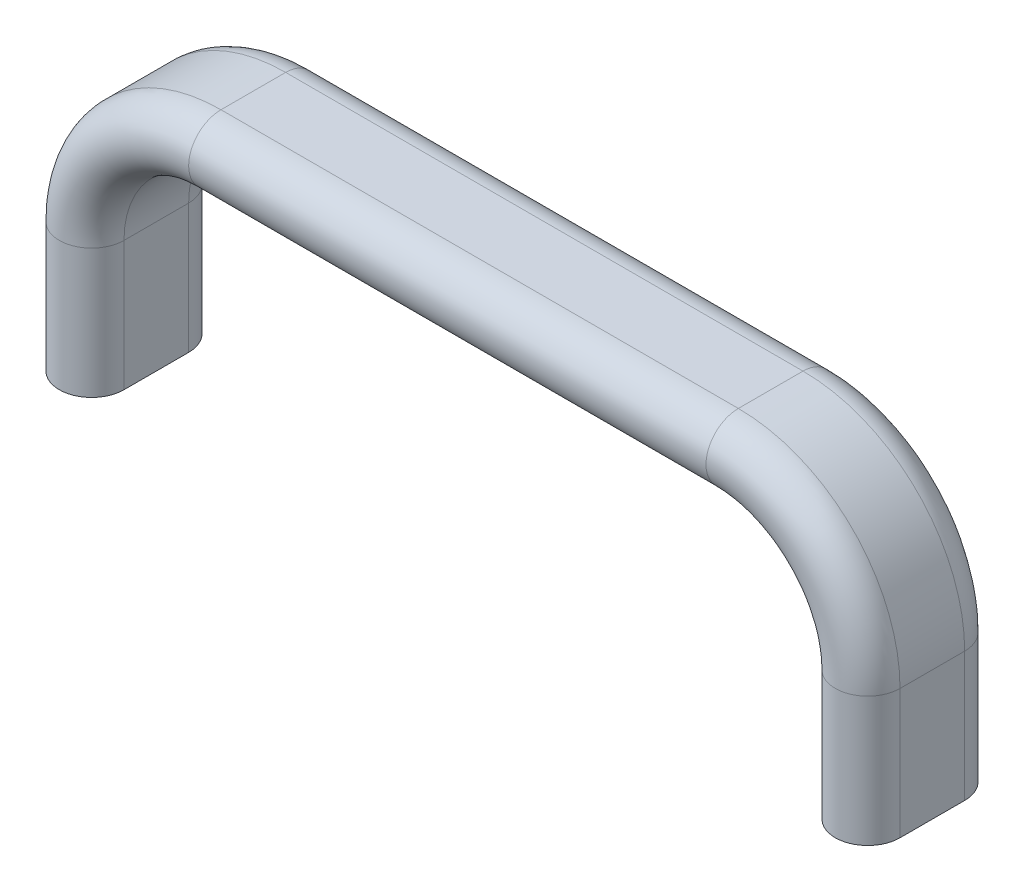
from build123d import *

# Parameters (mm, degrees)
SKETCH3_R      = 2.1
EXTRUDE1_DEPTH = 12.5
SKETCH4_R      = 2.5
EXTRUDE2_DEPTH = 10


with BuildPart() as part:
    # Sweep1: sweep along a path in Sketch1
    with BuildLine(Plane.XY) as sweep1_path:
        Line((-60, 0), (-60, 20))
        ThreePointArc((-60, 20), (-54.142135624, 34.142135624), (-40, 40))
        Line((-40, 40), (40, 40))
        ThreePointArc((40, 40), (54.142135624, 34.142135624), (60, 20))
        Line((60, 20), (60, 0))
    # Sketch2 → Sweep1 (sweep)
    with BuildSketch(Plane(origin=(0, 0, 0), x_dir=(1, 0, 0), z_dir=(0, 1, 0))):
        with BuildLine():
            Line((-65, -5), (-65, 5))
            ThreePointArc((-65, 5), (-60, 10), (-55, 5))
            Line((-55, 5), (-55, -5))
            ThreePointArc((-55, -5), (-60, -10), (-65, -5))
        make_face()
    sweep(path=sweep1_path.line)

    # Sketch3 → Extrude1 (cut)
    with BuildSketch(Plane.XZ):
        with Locations(Location((-60, 0, 0), (0, 0, 270))):
            Circle(SKETCH3_R)
    extrude1 = extrude(amount=-EXTRUDE1_DEPTH, mode=Mode.SUBTRACT)

    # Sketch4 → Extrude2 (cut)
    with BuildSketch(Plane.XZ):
        with Locations(Location((-60, 0, 0), (0, 0, 270))):
            Circle(SKETCH4_R)
    extrude2 = extrude(amount=-EXTRUDE2_DEPTH, mode=Mode.SUBTRACT)

    # Sketch5 → Cut-Revolve1 (revolve, cut)
    with BuildSketch(Plane.XY, mode=Mode.PRIVATE) as cut_revolve1_sk:
        Polygon((-60, 12.5), (-62.1, 12.5), (-60, 13.712435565), align=None)
    cut_revolve1 = revolve(cut_revolve1_sk.sketch.rotate(Axis((-60, 13.712435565, 0), (0, -1, 0)), 90), axis=Axis((-60, 13.712435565, 0), (0, -1, 0)), mode=Mode.SUBTRACT)

    # Mirror1: Extrude1, Extrude2, Cut-Revolve1 across plane
    add(extrude1.mirror(Plane(origin=(0, 0, 0), x_dir=(0, 0, 1), z_dir=(1, 0, 0))), mode=Mode.SUBTRACT)
    add(extrude2.mirror(Plane(origin=(0, 0, 0), x_dir=(0, 0, 1), z_dir=(1, 0, 0))), mode=Mode.SUBTRACT)
    add(cut_revolve1.mirror(Plane(origin=(0, 0, 0), x_dir=(0, 0, 1), z_dir=(1, 0, 0))), mode=Mode.SUBTRACT)


solid = part.part
